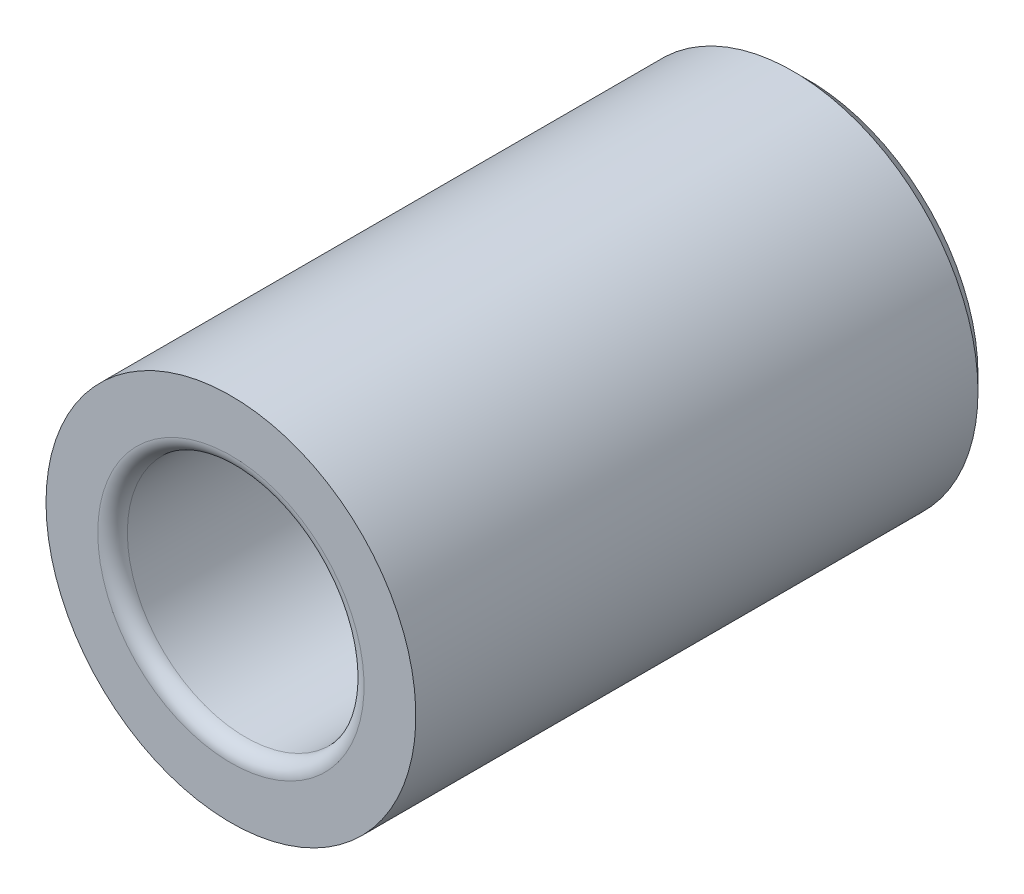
ISO-10303-21;
HEADER;
FILE_DESCRIPTION(('STEP AP214'),'2;1');
FILE_NAME('part.step','',(''),(''),'','','');
FILE_SCHEMA(('AUTOMOTIVE_DESIGN { 1 0 10303 214 1 1 1 1 }'));
ENDSEC;
DATA;
#1=APPLICATION_CONTEXT('core data for automotive mechanical design processes');
#2=APPLICATION_PROTOCOL_DEFINITION('international standard','automotive_design',2000,#1);
#3=PRODUCT_CONTEXT('',#1,'mechanical');
#4=PRODUCT('Part','Part','',(#3));
#5=PRODUCT_RELATED_PRODUCT_CATEGORY('part','',(#4));
#6=PRODUCT_DEFINITION_FORMATION('','',#4);
#7=PRODUCT_DEFINITION_CONTEXT('part definition',#1,'design');
#8=PRODUCT_DEFINITION('design','',#6,#7);
#9=PRODUCT_DEFINITION_SHAPE('','',#8);
#10=(LENGTH_UNIT() NAMED_UNIT(*) SI_UNIT(.MILLI.,.METRE.));
#11=(NAMED_UNIT(*) PLANE_ANGLE_UNIT() SI_UNIT($,.RADIAN.));
#12=(NAMED_UNIT(*) SI_UNIT($,.STERADIAN.) SOLID_ANGLE_UNIT());
#13=UNCERTAINTY_MEASURE_WITH_UNIT(LENGTH_MEASURE(1.E-05),#10,'distance_accuracy_value','');
#14=(GEOMETRIC_REPRESENTATION_CONTEXT(3) GLOBAL_UNCERTAINTY_ASSIGNED_CONTEXT((#13)) GLOBAL_UNIT_ASSIGNED_CONTEXT((#10,
#11,#12)) REPRESENTATION_CONTEXT('',''));
#15=CARTESIAN_POINT('',(0.,0.,0.));
#16=DIRECTION('',(0.,0.,1.));
#17=DIRECTION('',(1.,0.,0.));
#18=AXIS2_PLACEMENT_3D('',#15,#16,#17);
#19=CARTESIAN_POINT('',(0.,0.,-0.5));
#20=DIRECTION('',(0.,0.,-1.));
#21=DIRECTION('',(-1.,0.,0.));
#22=AXIS2_PLACEMENT_3D('',#19,#20,#21);
#23=PLANE('',#22);
#24=CARTESIAN_POINT('',(0.,0.,-0.5));
#25=DIRECTION('',(0.,0.,-1.));
#26=DIRECTION('',(-1.,0.,0.));
#27=AXIS2_PLACEMENT_3D('',#24,#25,#26);
#28=CIRCLE('',#27,9.);
#29=CARTESIAN_POINT('',(-9.,0.,-0.499999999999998));
#30=VERTEX_POINT('',#29);
#31=EDGE_CURVE('E50',#30,#30,#28,.T.);
#32=ORIENTED_EDGE('',*,*,#31,.T.);
#33=EDGE_LOOP('',(#32));
#34=FACE_BOUND('',#33,.T.);
#35=CARTESIAN_POINT('',(0.,0.,-0.5));
#36=DIRECTION('',(0.,0.,-1.));
#37=DIRECTION('',(-1.,0.,0.));
#38=AXIS2_PLACEMENT_3D('',#35,#36,#37);
#39=CIRCLE('',#38,12.5);
#40=CARTESIAN_POINT('',(-12.5,0.,-0.499999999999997));
#41=VERTEX_POINT('',#40);
#42=EDGE_CURVE('E64',#41,#41,#39,.T.);
#43=ORIENTED_EDGE('',*,*,#42,.F.);
#44=EDGE_LOOP('',(#43));
#45=FACE_BOUND('',#44,.T.);
#46=ADVANCED_FACE('F35',(#34,#45),#23,.F.);
#47=CARTESIAN_POINT('',(0.,0.,-0.5));
#48=DIRECTION('',(0.,0.,-1.));
#49=DIRECTION('',(-1.,0.,0.));
#50=AXIS2_PLACEMENT_3D('',#47,#48,#49);
#51=CYLINDRICAL_SURFACE('',#50,12.5);
#52=CARTESIAN_POINT('',(0.,0.,-38.5));
#53=DIRECTION('',(0.,0.,1.));
#54=DIRECTION('',(1.,0.,0.));
#55=AXIS2_PLACEMENT_3D('',#52,#53,#54);
#56=CIRCLE('',#55,12.5);
#57=CARTESIAN_POINT('',(12.5,0.,-38.5));
#58=VERTEX_POINT('',#57);
#59=EDGE_CURVE('E10',#58,#58,#56,.T.);
#60=ORIENTED_EDGE('',*,*,#59,.T.);
#61=EDGE_LOOP('',(#60));
#62=FACE_BOUND('',#61,.T.);
#63=ORIENTED_EDGE('',*,*,#42,.T.);
#64=EDGE_LOOP('',(#63));
#65=FACE_BOUND('',#64,.T.);
#66=ADVANCED_FACE('F82',(#62,#65),#51,.T.);
#67=CARTESIAN_POINT('',(0.,0.,-39.5));
#68=DIRECTION('',(0.,0.,1.));
#69=DIRECTION('',(1.,0.,0.));
#70=AXIS2_PLACEMENT_3D('',#67,#68,#69);
#71=PLANE('',#70);
#72=CARTESIAN_POINT('',(0.,0.,-39.5));
#73=DIRECTION('',(0.,0.,1.));
#74=DIRECTION('',(1.,0.,0.));
#75=AXIS2_PLACEMENT_3D('',#72,#73,#74);
#76=CIRCLE('',#75,11.5);
#77=CARTESIAN_POINT('',(11.5,0.,-39.5));
#78=VERTEX_POINT('',#77);
#79=EDGE_CURVE('E42',#78,#78,#76,.F.);
#80=ORIENTED_EDGE('',*,*,#79,.T.);
#81=EDGE_LOOP('',(#80));
#82=FACE_BOUND('',#81,.T.);
#83=CARTESIAN_POINT('',(0.,0.,-39.5));
#84=DIRECTION('',(0.,0.,-1.));
#85=DIRECTION('',(-1.,0.,0.));
#86=AXIS2_PLACEMENT_3D('',#83,#84,#85);
#87=CIRCLE('',#86,3.4);
#88=CARTESIAN_POINT('',(-3.40000000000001,0.,-39.5));
#89=VERTEX_POINT('',#88);
#90=EDGE_CURVE('E73',#89,#89,#87,.T.);
#91=ORIENTED_EDGE('',*,*,#90,.F.);
#92=EDGE_LOOP('',(#91));
#93=FACE_BOUND('',#92,.T.);
#94=ADVANCED_FACE('F79',(#82,#93),#71,.F.);
#95=CARTESIAN_POINT('',(0.,0.,-0.5));
#96=DIRECTION('',(0.,0.,-1.));
#97=DIRECTION('',(-1.,0.,0.));
#98=AXIS2_PLACEMENT_3D('',#95,#96,#97);
#99=CYLINDRICAL_SURFACE('',#98,9.24999999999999);
#100=CARTESIAN_POINT('',(0.,0.,-19.75));
#101=DIRECTION('',(0.,0.,-1.));
#102=DIRECTION('',(-1.,0.,0.));
#103=AXIS2_PLACEMENT_3D('',#100,#101,#102);
#104=CIRCLE('',#103,9.24999999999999);
#105=CARTESIAN_POINT('',(-9.25,0.,-19.75));
#106=VERTEX_POINT('',#105);
#107=EDGE_CURVE('E58',#106,#106,#104,.F.);
#108=ORIENTED_EDGE('',*,*,#107,.T.);
#109=EDGE_LOOP('',(#108));
#110=FACE_BOUND('',#109,.T.);
#111=CARTESIAN_POINT('',(0.,0.,-24.75));
#112=DIRECTION('',(0.,0.,1.));
#113=DIRECTION('',(1.,0.,0.));
#114=AXIS2_PLACEMENT_3D('',#111,#112,#113);
#115=CIRCLE('',#114,9.24999999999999);
#116=CARTESIAN_POINT('',(9.24999999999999,0.,-24.75));
#117=VERTEX_POINT('',#116);
#118=EDGE_CURVE('E61',#117,#117,#115,.F.);
#119=ORIENTED_EDGE('',*,*,#118,.T.);
#120=EDGE_LOOP('',(#119));
#121=FACE_BOUND('',#120,.T.);
#122=ADVANCED_FACE('F81',(#110,#121),#99,.F.);
#123=CARTESIAN_POINT('',(0.,0.,-26.));
#124=DIRECTION('',(0.,0.,1.));
#125=DIRECTION('',(1.,0.,0.));
#126=AXIS2_PLACEMENT_3D('',#123,#124,#125);
#127=PLANE('',#126);
#128=CARTESIAN_POINT('',(0.,0.,-26.));
#129=DIRECTION('',(0.,0.,1.));
#130=DIRECTION('',(1.,0.,0.));
#131=AXIS2_PLACEMENT_3D('',#128,#129,#130);
#132=CIRCLE('',#131,3.39999999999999);
#133=CARTESIAN_POINT('',(3.39999999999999,0.,-26.));
#134=VERTEX_POINT('',#133);
#135=EDGE_CURVE('E70',#134,#134,#132,.T.);
#136=ORIENTED_EDGE('',*,*,#135,.F.);
#137=EDGE_LOOP('',(#136));
#138=FACE_BOUND('',#137,.T.);
#139=CARTESIAN_POINT('',(0.,0.,-26.));
#140=DIRECTION('',(0.,0.,1.));
#141=DIRECTION('',(1.,0.,0.));
#142=AXIS2_PLACEMENT_3D('',#139,#140,#141);
#143=CIRCLE('',#142,7.99999999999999);
#144=CARTESIAN_POINT('',(7.99999999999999,0.,-26.));
#145=VERTEX_POINT('',#144);
#146=EDGE_CURVE('E55',#145,#145,#143,.T.);
#147=ORIENTED_EDGE('',*,*,#146,.T.);
#148=EDGE_LOOP('',(#147));
#149=FACE_BOUND('',#148,.T.);
#150=ADVANCED_FACE('F88',(#138,#149),#127,.T.);
#151=CARTESIAN_POINT('',(0.,0.,-0.5));
#152=DIRECTION('',(0.,0.,-1.));
#153=DIRECTION('',(-1.,0.,0.));
#154=AXIS2_PLACEMENT_3D('',#151,#152,#153);
#155=CYLINDRICAL_SURFACE('',#154,8.);
#156=CARTESIAN_POINT('',(0.,0.,-1.5));
#157=DIRECTION('',(0.,0.,-1.));
#158=DIRECTION('',(-1.,0.,0.));
#159=AXIS2_PLACEMENT_3D('',#156,#157,#158);
#160=CIRCLE('',#159,8.);
#161=CARTESIAN_POINT('',(-8.,0.,-1.5));
#162=VERTEX_POINT('',#161);
#163=EDGE_CURVE('E46',#162,#162,#160,.F.);
#164=ORIENTED_EDGE('',*,*,#163,.T.);
#165=EDGE_LOOP('',(#164));
#166=FACE_BOUND('',#165,.T.);
#167=CARTESIAN_POINT('',(0.,0.,-18.5));
#168=DIRECTION('',(0.,0.,-1.));
#169=DIRECTION('',(-1.,0.,0.));
#170=AXIS2_PLACEMENT_3D('',#167,#168,#169);
#171=CIRCLE('',#170,8.);
#172=CARTESIAN_POINT('',(-8.,0.,-18.5));
#173=VERTEX_POINT('',#172);
#174=EDGE_CURVE('E67',#173,#173,#171,.T.);
#175=ORIENTED_EDGE('',*,*,#174,.T.);
#176=EDGE_LOOP('',(#175));
#177=FACE_BOUND('',#176,.T.);
#178=ADVANCED_FACE('F103',(#166,#177),#155,.F.);
#179=CARTESIAN_POINT('',(0.,0.,-19.75));
#180=DIRECTION('',(0.,0.,-1.));
#181=DIRECTION('',(-1.,0.,0.));
#182=AXIS2_PLACEMENT_3D('',#179,#180,#181);
#183=TOROIDAL_SURFACE('',#182,7.99999999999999,1.25);
#184=ORIENTED_EDGE('',*,*,#107,.F.);
#185=EDGE_LOOP('',(#184));
#186=FACE_BOUND('',#185,.T.);
#187=ORIENTED_EDGE('',*,*,#174,.F.);
#188=EDGE_LOOP('',(#187));
#189=FACE_BOUND('',#188,.T.);
#190=ADVANCED_FACE('F99',(#186,#189),#183,.F.);
#191=CARTESIAN_POINT('',(0.,0.,-24.75));
#192=DIRECTION('',(0.,0.,1.));
#193=DIRECTION('',(1.,0.,0.));
#194=AXIS2_PLACEMENT_3D('',#191,#192,#193);
#195=TOROIDAL_SURFACE('',#194,7.99999999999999,1.25);
#196=ORIENTED_EDGE('',*,*,#146,.F.);
#197=EDGE_LOOP('',(#196));
#198=FACE_BOUND('',#197,.T.);
#199=ORIENTED_EDGE('',*,*,#118,.F.);
#200=EDGE_LOOP('',(#199));
#201=FACE_BOUND('',#200,.T.);
#202=ADVANCED_FACE('F102',(#198,#201),#195,.F.);
#203=CARTESIAN_POINT('',(0.,0.,-39.5));
#204=DIRECTION('',(0.,0.,-1.));
#205=DIRECTION('',(-1.,0.,0.));
#206=AXIS2_PLACEMENT_3D('',#203,#204,#205);
#207=CYLINDRICAL_SURFACE('',#206,3.39999999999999);
#208=ORIENTED_EDGE('',*,*,#135,.T.);
#209=EDGE_LOOP('',(#208));
#210=FACE_BOUND('',#209,.T.);
#211=ORIENTED_EDGE('',*,*,#90,.T.);
#212=EDGE_LOOP('',(#211));
#213=FACE_BOUND('',#212,.T.);
#214=ADVANCED_FACE('F77',(#210,#213),#207,.F.);
#215=CARTESIAN_POINT('',(0.,0.,-1.5));
#216=DIRECTION('',(0.,0.,-1.));
#217=DIRECTION('',(-1.,0.,0.));
#218=AXIS2_PLACEMENT_3D('',#215,#216,#217);
#219=TOROIDAL_SURFACE('',#218,9.,1.);
#220=ORIENTED_EDGE('',*,*,#163,.F.);
#221=EDGE_LOOP('',(#220));
#222=FACE_BOUND('',#221,.T.);
#223=ORIENTED_EDGE('',*,*,#31,.F.);
#224=EDGE_LOOP('',(#223));
#225=FACE_BOUND('',#224,.T.);
#226=ADVANCED_FACE('F107',(#222,#225),#219,.T.);
#227=CARTESIAN_POINT('',(0.,0.,-39.5));
#228=DIRECTION('',(0.,0.,1.));
#229=DIRECTION('',(1.,0.,0.));
#230=AXIS2_PLACEMENT_3D('',#227,#228,#229);
#231=CONICAL_SURFACE('',#230,11.5,0.785398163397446);
#232=ORIENTED_EDGE('',*,*,#59,.F.);
#233=EDGE_LOOP('',(#232));
#234=FACE_BOUND('',#233,.T.);
#235=ORIENTED_EDGE('',*,*,#79,.F.);
#236=EDGE_LOOP('',(#235));
#237=FACE_BOUND('',#236,.T.);
#238=ADVANCED_FACE('F37',(#234,#237),#231,.T.);
#239=CLOSED_SHELL('',(#46,#66,#94,#122,#150,#178,#190,#202,#214,#226,#238));
#240=MANIFOLD_SOLID_BREP('B2',#239);
#241=ADVANCED_BREP_SHAPE_REPRESENTATION('',(#18,#240),#14);
#242=SHAPE_DEFINITION_REPRESENTATION(#9,#241);
ENDSEC;
END-ISO-10303-21;
